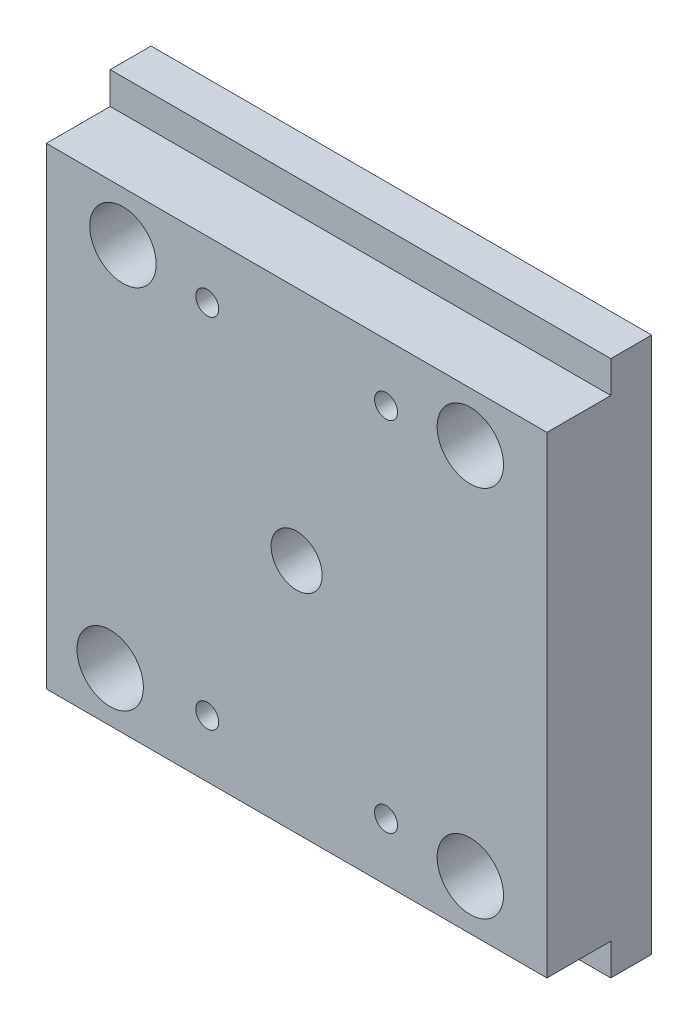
ISO-10303-21;
HEADER;
FILE_DESCRIPTION(('STEP AP214'),'2;1');
FILE_NAME('part.step','',(''),(''),'','','');
FILE_SCHEMA(('AUTOMOTIVE_DESIGN { 1 0 10303 214 1 1 1 1 }'));
ENDSEC;
DATA;
#1=APPLICATION_CONTEXT('core data for automotive mechanical design processes');
#2=APPLICATION_PROTOCOL_DEFINITION('international standard','automotive_design',2000,#1);
#3=PRODUCT_CONTEXT('',#1,'mechanical');
#4=PRODUCT('Part','Part','',(#3));
#5=PRODUCT_RELATED_PRODUCT_CATEGORY('part','',(#4));
#6=PRODUCT_DEFINITION_FORMATION('','',#4);
#7=PRODUCT_DEFINITION_CONTEXT('part definition',#1,'design');
#8=PRODUCT_DEFINITION('design','',#6,#7);
#9=PRODUCT_DEFINITION_SHAPE('','',#8);
#10=(LENGTH_UNIT() NAMED_UNIT(*) SI_UNIT(.MILLI.,.METRE.));
#11=(NAMED_UNIT(*) PLANE_ANGLE_UNIT() SI_UNIT($,.RADIAN.));
#12=(NAMED_UNIT(*) SI_UNIT($,.STERADIAN.) SOLID_ANGLE_UNIT());
#13=UNCERTAINTY_MEASURE_WITH_UNIT(LENGTH_MEASURE(1.E-05),#10,'distance_accuracy_value','');
#14=(GEOMETRIC_REPRESENTATION_CONTEXT(3) GLOBAL_UNCERTAINTY_ASSIGNED_CONTEXT((#13)) GLOBAL_UNIT_ASSIGNED_CONTEXT((#10,
#11,#12)) REPRESENTATION_CONTEXT('',''));
#15=CARTESIAN_POINT('',(0.,0.,0.));
#16=DIRECTION('',(0.,0.,1.));
#17=DIRECTION('',(1.,0.,0.));
#18=AXIS2_PLACEMENT_3D('',#15,#16,#17);
#19=CARTESIAN_POINT('',(0.,0.,16.0000000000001));
#20=DIRECTION('',(0.,0.,-1.00000000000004));
#21=DIRECTION('',(-1.,0.,0.));
#22=AXIS2_PLACEMENT_3D('',#19,#20,#21);
#23=PLANE('',#22);
#24=DIRECTION('',(-1.,0.,0.));
#25=VECTOR('',#24,1.);
#26=CARTESIAN_POINT('',(3.86496390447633E-12,197.500000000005,16.));
#27=LINE('',#26,#25);
#28=CARTESIAN_POINT('',(196.,197.50000000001,16.));
#29=VERTEX_POINT('',#28);
#30=CARTESIAN_POINT('',(3.86496390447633E-12,197.500000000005,16.));
#31=VERTEX_POINT('',#30);
#32=EDGE_CURVE('E54',#29,#31,#27,.T.);
#33=ORIENTED_EDGE('',*,*,#32,.F.);
#34=DIRECTION('',(0.,1.00000000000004,0.));
#35=VECTOR('',#34,1.);
#36=CARTESIAN_POINT('',(196.,0.,16.));
#37=LINE('',#36,#35);
#38=CARTESIAN_POINT('',(196.,210.00000000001,16.0000000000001));
#39=VERTEX_POINT('',#38);
#40=EDGE_CURVE('E111',#29,#39,#37,.T.);
#41=ORIENTED_EDGE('',*,*,#40,.T.);
#42=DIRECTION('',(-1.,0.,0.));
#43=VECTOR('',#42,1.);
#44=CARTESIAN_POINT('',(3.87190279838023E-12,210.000000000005,16.));
#45=LINE('',#44,#43);
#46=CARTESIAN_POINT('',(3.87190279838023E-12,210.000000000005,16.));
#47=VERTEX_POINT('',#46);
#48=EDGE_CURVE('E110',#39,#47,#45,.T.);
#49=ORIENTED_EDGE('',*,*,#48,.T.);
#50=DIRECTION('',(0.,-1.00000000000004,0.));
#51=VECTOR('',#50,1.);
#52=CARTESIAN_POINT('',(0.,0.,16.0000000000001));
#53=LINE('',#52,#51);
#54=EDGE_CURVE('E170',#47,#31,#53,.T.);
#55=ORIENTED_EDGE('',*,*,#54,.T.);
#56=EDGE_LOOP('',(#33,#41,#49,#55));
#57=FACE_BOUND('',#56,.T.);
#58=ADVANCED_FACE('F37',(#57),#23,.F.);
#59=DIRECTION('',(1.,0.,0.));
#60=VECTOR('',#59,1.);
#61=CARTESIAN_POINT('',(6.66133814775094E-13,12.5,16.0000000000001));
#62=LINE('',#61,#60);
#63=CARTESIAN_POINT('',(6.45317133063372E-13,12.5,16.0000000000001));
#64=VERTEX_POINT('',#63);
#65=CARTESIAN_POINT('',(196.,12.5,16.));
#66=VERTEX_POINT('',#65);
#67=EDGE_CURVE('E62',#64,#66,#62,.T.);
#68=ORIENTED_EDGE('',*,*,#67,.F.);
#69=CARTESIAN_POINT('',(0.,0.,16.0000000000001));
#70=VERTEX_POINT('',#69);
#71=EDGE_CURVE('E163',#64,#70,#53,.T.);
#72=ORIENTED_EDGE('',*,*,#71,.T.);
#73=DIRECTION('',(1.,0.,0.));
#74=VECTOR('',#73,1.);
#75=CARTESIAN_POINT('',(0.,0.,16.0000000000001));
#76=LINE('',#75,#74);
#77=CARTESIAN_POINT('',(196.,0.,16.));
#78=VERTEX_POINT('',#77);
#79=EDGE_CURVE('E105',#70,#78,#76,.T.);
#80=ORIENTED_EDGE('',*,*,#79,.T.);
#81=EDGE_CURVE('E102',#78,#66,#37,.T.);
#82=ORIENTED_EDGE('',*,*,#81,.T.);
#83=EDGE_LOOP('',(#68,#72,#80,#82));
#84=FACE_BOUND('',#83,.T.);
#85=ADVANCED_FACE('F103',(#84),#23,.F.);
#86=CARTESIAN_POINT('',(0.,0.,16.0000000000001));
#87=DIRECTION('',(1.,0.,0.));
#88=DIRECTION('',(0.,0.,-1.00000000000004));
#89=AXIS2_PLACEMENT_3D('',#86,#87,#88);
#90=PLANE('',#89);
#91=DIRECTION('',(0.,-1.00000000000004,0.));
#92=VECTOR('',#91,1.);
#93=CARTESIAN_POINT('',(0.,0.,0.));
#94=LINE('',#93,#92);
#95=CARTESIAN_POINT('',(3.87190279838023E-12,210.00000000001,0.));
#96=VERTEX_POINT('',#95);
#97=CARTESIAN_POINT('',(0.,0.,0.));
#98=VERTEX_POINT('',#97);
#99=EDGE_CURVE('E128',#96,#98,#94,.T.);
#100=ORIENTED_EDGE('',*,*,#99,.T.);
#101=DIRECTION('',(0.,0.,-1.00000000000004));
#102=VECTOR('',#101,1.);
#103=CARTESIAN_POINT('',(0.,0.,16.0000000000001));
#104=LINE('',#103,#102);
#105=EDGE_CURVE('E11',#70,#98,#104,.T.);
#106=ORIENTED_EDGE('',*,*,#105,.F.);
#107=ORIENTED_EDGE('',*,*,#71,.F.);
#108=DIRECTION('',(0.,0.,-1.00000000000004));
#109=VECTOR('',#108,1.);
#110=CARTESIAN_POINT('',(0.,12.5,41.0000000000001));
#111=LINE('',#110,#109);
#112=CARTESIAN_POINT('',(0.,12.5,41.0000000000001));
#113=VERTEX_POINT('',#112);
#114=EDGE_CURVE('E120',#113,#64,#111,.T.);
#115=ORIENTED_EDGE('',*,*,#114,.F.);
#116=DIRECTION('',(0.,-1.00000000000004,0.));
#117=VECTOR('',#116,1.);
#118=CARTESIAN_POINT('',(3.87190279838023E-12,197.50000000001,41.0000000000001));
#119=LINE('',#118,#117);
#120=CARTESIAN_POINT('',(3.87190279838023E-12,197.50000000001,41.0000000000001));
#121=VERTEX_POINT('',#120);
#122=EDGE_CURVE('E142',#121,#113,#119,.T.);
#123=ORIENTED_EDGE('',*,*,#122,.F.);
#124=DIRECTION('',(0.,0.,-1.00000000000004));
#125=VECTOR('',#124,1.);
#126=CARTESIAN_POINT('',(3.87190279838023E-12,197.50000000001,41.0000000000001));
#127=LINE('',#126,#125);
#128=EDGE_CURVE('E131',#121,#31,#127,.T.);
#129=ORIENTED_EDGE('',*,*,#128,.T.);
#130=ORIENTED_EDGE('',*,*,#54,.F.);
#131=DIRECTION('',(0.,0.,-1.00000000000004));
#132=VECTOR('',#131,1.);
#133=CARTESIAN_POINT('',(3.87190279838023E-12,210.000000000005,16.));
#134=LINE('',#133,#132);
#135=EDGE_CURVE('E176',#47,#96,#134,.T.);
#136=ORIENTED_EDGE('',*,*,#135,.T.);
#137=EDGE_LOOP('',(#100,#106,#107,#115,#123,#129,#130,#136));
#138=FACE_BOUND('',#137,.T.);
#139=ADVANCED_FACE('F39',(#138),#90,.F.);
#140=CARTESIAN_POINT('',(0.,0.,16.0000000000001));
#141=DIRECTION('',(0.,1.00000000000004,0.));
#142=DIRECTION('',(0.,0.,1.00000000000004));
#143=AXIS2_PLACEMENT_3D('',#140,#141,#142);
#144=PLANE('',#143);
#145=DIRECTION('',(1.,0.,0.));
#146=VECTOR('',#145,1.);
#147=CARTESIAN_POINT('',(0.,0.,0.));
#148=LINE('',#147,#146);
#149=CARTESIAN_POINT('',(196.000000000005,0.,0.));
#150=VERTEX_POINT('',#149);
#151=EDGE_CURVE('E157',#98,#150,#148,.T.);
#152=ORIENTED_EDGE('',*,*,#151,.T.);
#153=DIRECTION('',(0.,0.,-1.00000000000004));
#154=VECTOR('',#153,1.);
#155=CARTESIAN_POINT('',(196.,0.,16.));
#156=LINE('',#155,#154);
#157=EDGE_CURVE('E46',#78,#150,#156,.T.);
#158=ORIENTED_EDGE('',*,*,#157,.F.);
#159=ORIENTED_EDGE('',*,*,#79,.F.);
#160=ORIENTED_EDGE('',*,*,#105,.T.);
#161=EDGE_LOOP('',(#152,#158,#159,#160));
#162=FACE_BOUND('',#161,.T.);
#163=ADVANCED_FACE('F201',(#162),#144,.F.);
#164=CARTESIAN_POINT('',(196.,0.,16.));
#165=DIRECTION('',(-1.,0.,0.));
#166=DIRECTION('',(0.,0.,1.00000000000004));
#167=AXIS2_PLACEMENT_3D('',#164,#165,#166);
#168=PLANE('',#167);
#169=DIRECTION('',(0.,1.00000000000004,0.));
#170=VECTOR('',#169,1.);
#171=CARTESIAN_POINT('',(196.000000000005,0.,0.));
#172=LINE('',#171,#170);
#173=CARTESIAN_POINT('',(196.000000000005,210.00000000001,0.));
#174=VERTEX_POINT('',#173);
#175=EDGE_CURVE('E159',#150,#174,#172,.T.);
#176=ORIENTED_EDGE('',*,*,#175,.T.);
#177=DIRECTION('',(0.,0.,-1.00000000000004));
#178=VECTOR('',#177,1.);
#179=CARTESIAN_POINT('',(196.,210.00000000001,16.0000000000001));
#180=LINE('',#179,#178);
#181=EDGE_CURVE('E173',#39,#174,#180,.T.);
#182=ORIENTED_EDGE('',*,*,#181,.F.);
#183=ORIENTED_EDGE('',*,*,#40,.F.);
#184=DIRECTION('',(0.,0.,-1.00000000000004));
#185=VECTOR('',#184,1.);
#186=CARTESIAN_POINT('',(196.,197.50000000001,41.0000000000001));
#187=LINE('',#186,#185);
#188=CARTESIAN_POINT('',(196.,197.50000000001,41.0000000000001));
#189=VERTEX_POINT('',#188);
#190=EDGE_CURVE('E126',#189,#29,#187,.T.);
#191=ORIENTED_EDGE('',*,*,#190,.F.);
#192=DIRECTION('',(0.,1.00000000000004,0.));
#193=VECTOR('',#192,1.);
#194=CARTESIAN_POINT('',(196.,197.50000000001,41.0000000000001));
#195=LINE('',#194,#193);
#196=CARTESIAN_POINT('',(196.,12.5,41.0000000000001));
#197=VERTEX_POINT('',#196);
#198=EDGE_CURVE('E125',#197,#189,#195,.T.);
#199=ORIENTED_EDGE('',*,*,#198,.F.);
#200=DIRECTION('',(0.,0.,-1.00000000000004));
#201=VECTOR('',#200,1.);
#202=CARTESIAN_POINT('',(196.,12.5,41.0000000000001));
#203=LINE('',#202,#201);
#204=EDGE_CURVE('E117',#197,#66,#203,.T.);
#205=ORIENTED_EDGE('',*,*,#204,.T.);
#206=ORIENTED_EDGE('',*,*,#81,.F.);
#207=ORIENTED_EDGE('',*,*,#157,.T.);
#208=EDGE_LOOP('',(#176,#182,#183,#191,#199,#205,#206,#207));
#209=FACE_BOUND('',#208,.T.);
#210=ADVANCED_FACE('F123',(#209),#168,.F.);
#211=CARTESIAN_POINT('',(3.87190279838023E-12,210.000000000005,16.));
#212=DIRECTION('',(0.,-1.00000000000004,0.));
#213=DIRECTION('',(1.,0.,0.));
#214=AXIS2_PLACEMENT_3D('',#211,#212,#213);
#215=PLANE('',#214);
#216=DIRECTION('',(-1.,0.,0.));
#217=VECTOR('',#216,1.);
#218=CARTESIAN_POINT('',(3.87190279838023E-12,210.00000000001,0.));
#219=LINE('',#218,#217);
#220=EDGE_CURVE('E161',#174,#96,#219,.T.);
#221=ORIENTED_EDGE('',*,*,#220,.T.);
#222=ORIENTED_EDGE('',*,*,#135,.F.);
#223=ORIENTED_EDGE('',*,*,#48,.F.);
#224=ORIENTED_EDGE('',*,*,#181,.T.);
#225=EDGE_LOOP('',(#221,#222,#223,#224));
#226=FACE_BOUND('',#225,.T.);
#227=ADVANCED_FACE('F187',(#226),#215,.F.);
#228=CARTESIAN_POINT('',(0.,0.,0.));
#229=DIRECTION('',(0.,0.,-1.00000000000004));
#230=DIRECTION('',(-1.,0.,0.));
#231=AXIS2_PLACEMENT_3D('',#228,#229,#230);
#232=PLANE('',#231);
#233=CARTESIAN_POINT('',(63.,35.,0.));
#234=DIRECTION('',(0.,0.,-1.00000000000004));
#235=DIRECTION('',(-1.,0.,0.));
#236=AXIS2_PLACEMENT_3D('',#233,#234,#235);
#237=CIRCLE('',#236,7.49999999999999);
#238=CARTESIAN_POINT('',(55.5,34.9999999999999,0.));
#239=VERTEX_POINT('',#238);
#240=EDGE_CURVE('E459',#239,#239,#237,.T.);
#241=ORIENTED_EDGE('',*,*,#240,.F.);
#242=EDGE_LOOP('',(#241));
#243=FACE_BOUND('',#242,.T.);
#244=CARTESIAN_POINT('',(133.000000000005,35.0000000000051,0.));
#245=DIRECTION('',(0.,0.,-1.00000000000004));
#246=DIRECTION('',(-1.,0.,0.));
#247=AXIS2_PLACEMENT_3D('',#244,#245,#246);
#248=CIRCLE('',#247,7.50000000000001);
#249=CARTESIAN_POINT('',(125.500000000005,35.000000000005,0.));
#250=VERTEX_POINT('',#249);
#251=EDGE_CURVE('E470',#250,#250,#248,.T.);
#252=ORIENTED_EDGE('',*,*,#251,.F.);
#253=EDGE_LOOP('',(#252));
#254=FACE_BOUND('',#253,.T.);
#255=CARTESIAN_POINT('',(133.000000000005,175.,0.));
#256=DIRECTION('',(0.,0.,-1.00000000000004));
#257=DIRECTION('',(-1.,0.,0.));
#258=AXIS2_PLACEMENT_3D('',#255,#256,#257);
#259=CIRCLE('',#258,7.50000000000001);
#260=CARTESIAN_POINT('',(125.500000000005,175.,0.));
#261=VERTEX_POINT('',#260);
#262=EDGE_CURVE('E480',#261,#261,#259,.T.);
#263=ORIENTED_EDGE('',*,*,#262,.F.);
#264=EDGE_LOOP('',(#263));
#265=FACE_BOUND('',#264,.T.);
#266=CARTESIAN_POINT('',(63.0000000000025,175.000000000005,0.));
#267=DIRECTION('',(0.,0.,-1.00000000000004));
#268=DIRECTION('',(-1.,0.,0.));
#269=AXIS2_PLACEMENT_3D('',#266,#267,#268);
#270=CIRCLE('',#269,7.49999999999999);
#271=CARTESIAN_POINT('',(55.5000000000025,175.000000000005,0.));
#272=VERTEX_POINT('',#271);
#273=EDGE_CURVE('E490',#272,#272,#270,.T.);
#274=ORIENTED_EDGE('',*,*,#273,.F.);
#275=EDGE_LOOP('',(#274));
#276=FACE_BOUND('',#275,.T.);
#277=CARTESIAN_POINT('',(98.,105.000000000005,0.));
#278=DIRECTION('',(0.,0.,-1.00000000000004));
#279=DIRECTION('',(-1.,0.,0.));
#280=AXIS2_PLACEMENT_3D('',#277,#278,#279);
#281=CIRCLE('',#280,9.99999999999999);
#282=CARTESIAN_POINT('',(88.,105.000000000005,0.));
#283=VERTEX_POINT('',#282);
#284=EDGE_CURVE('E494',#283,#283,#281,.T.);
#285=ORIENTED_EDGE('',*,*,#284,.F.);
#286=EDGE_LOOP('',(#285));
#287=FACE_BOUND('',#286,.T.);
#288=CARTESIAN_POINT('',(25.0000000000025,32.,0.));
#289=DIRECTION('',(0.,0.,-1.00000000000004));
#290=DIRECTION('',(-1.,0.,0.));
#291=AXIS2_PLACEMENT_3D('',#288,#289,#290);
#292=CIRCLE('',#291,13.);
#293=CARTESIAN_POINT('',(12.0000000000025,31.9999999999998,0.));
#294=VERTEX_POINT('',#293);
#295=EDGE_CURVE('E498',#294,#294,#292,.T.);
#296=ORIENTED_EDGE('',*,*,#295,.F.);
#297=EDGE_LOOP('',(#296));
#298=FACE_BOUND('',#297,.T.);
#299=CARTESIAN_POINT('',(166.000000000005,32.0000000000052,0.));
#300=DIRECTION('',(0.,0.,-1.00000000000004));
#301=DIRECTION('',(-1.,0.,0.));
#302=AXIS2_PLACEMENT_3D('',#299,#300,#301);
#303=CIRCLE('',#302,13.);
#304=CARTESIAN_POINT('',(153.000000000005,32.000000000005,0.));
#305=VERTEX_POINT('',#304);
#306=EDGE_CURVE('E502',#305,#305,#303,.T.);
#307=ORIENTED_EDGE('',*,*,#306,.F.);
#308=EDGE_LOOP('',(#307));
#309=FACE_BOUND('',#308,.T.);
#310=CARTESIAN_POINT('',(166.00000000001,178.000000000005,0.));
#311=DIRECTION('',(0.,0.,-1.00000000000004));
#312=DIRECTION('',(-1.,0.,0.));
#313=AXIS2_PLACEMENT_3D('',#310,#311,#312);
#314=CIRCLE('',#313,13.);
#315=CARTESIAN_POINT('',(153.00000000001,178.000000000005,0.));
#316=VERTEX_POINT('',#315);
#317=EDGE_CURVE('E506',#316,#316,#314,.T.);
#318=ORIENTED_EDGE('',*,*,#317,.F.);
#319=EDGE_LOOP('',(#318));
#320=FACE_BOUND('',#319,.T.);
#321=CARTESIAN_POINT('',(30.0000000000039,178.,0.));
#322=DIRECTION('',(0.,0.,-1.00000000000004));
#323=DIRECTION('',(-1.,0.,0.));
#324=AXIS2_PLACEMENT_3D('',#321,#322,#323);
#325=CIRCLE('',#324,13.);
#326=CARTESIAN_POINT('',(17.0000000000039,178.,0.));
#327=VERTEX_POINT('',#326);
#328=EDGE_CURVE('E509',#327,#327,#325,.T.);
#329=ORIENTED_EDGE('',*,*,#328,.F.);
#330=EDGE_LOOP('',(#329));
#331=FACE_BOUND('',#330,.T.);
#332=ORIENTED_EDGE('',*,*,#99,.F.);
#333=ORIENTED_EDGE('',*,*,#220,.F.);
#334=ORIENTED_EDGE('',*,*,#175,.F.);
#335=ORIENTED_EDGE('',*,*,#151,.F.);
#336=EDGE_LOOP('',(#332,#333,#334,#335));
#337=FACE_BOUND('',#336,.T.);
#338=ADVANCED_FACE('F203',(#243,#254,#265,#276,#287,#298,#309,#320,#331,#337),#232,.T.);
#339=CARTESIAN_POINT('',(0.,12.5,41.0000000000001));
#340=DIRECTION('',(0.,1.00000000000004,0.));
#341=DIRECTION('',(0.,0.,1.00000000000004));
#342=AXIS2_PLACEMENT_3D('',#339,#340,#341);
#343=PLANE('',#342);
#344=ORIENTED_EDGE('',*,*,#67,.T.);
#345=ORIENTED_EDGE('',*,*,#204,.F.);
#346=DIRECTION('',(1.,0.,0.));
#347=VECTOR('',#346,1.);
#348=CARTESIAN_POINT('',(0.,12.5,41.0000000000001));
#349=LINE('',#348,#347);
#350=EDGE_CURVE('E150',#113,#197,#349,.T.);
#351=ORIENTED_EDGE('',*,*,#350,.F.);
#352=ORIENTED_EDGE('',*,*,#114,.T.);
#353=EDGE_LOOP('',(#344,#345,#351,#352));
#354=FACE_BOUND('',#353,.T.);
#355=ADVANCED_FACE('F116',(#354),#343,.F.);
#356=CARTESIAN_POINT('',(3.87190279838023E-12,197.50000000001,41.0000000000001));
#357=DIRECTION('',(0.,-1.00000000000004,0.));
#358=DIRECTION('',(0.,0.,-1.00000000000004));
#359=AXIS2_PLACEMENT_3D('',#356,#357,#358);
#360=PLANE('',#359);
#361=ORIENTED_EDGE('',*,*,#32,.T.);
#362=ORIENTED_EDGE('',*,*,#128,.F.);
#363=DIRECTION('',(-1.,0.,0.));
#364=VECTOR('',#363,1.);
#365=CARTESIAN_POINT('',(3.87190279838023E-12,197.50000000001,41.0000000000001));
#366=LINE('',#365,#364);
#367=EDGE_CURVE('E153',#189,#121,#366,.T.);
#368=ORIENTED_EDGE('',*,*,#367,.F.);
#369=ORIENTED_EDGE('',*,*,#190,.T.);
#370=EDGE_LOOP('',(#361,#362,#368,#369));
#371=FACE_BOUND('',#370,.T.);
#372=ADVANCED_FACE('F195',(#371),#360,.F.);
#373=CARTESIAN_POINT('',(0.,12.5,41.0000000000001));
#374=DIRECTION('',(0.,0.,1.00000000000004));
#375=DIRECTION('',(1.,0.,0.));
#376=AXIS2_PLACEMENT_3D('',#373,#374,#375);
#377=PLANE('',#376);
#378=CARTESIAN_POINT('',(63.,35.,41.0000000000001));
#379=DIRECTION('',(0.,0.,1.00000000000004));
#380=DIRECTION('',(1.,0.,0.));
#381=AXIS2_PLACEMENT_3D('',#378,#379,#380);
#382=CIRCLE('',#381,4.5);
#383=CARTESIAN_POINT('',(67.4999999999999,35.0000000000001,41.0000000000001));
#384=VERTEX_POINT('',#383);
#385=EDGE_CURVE('E41',#384,#384,#382,.T.);
#386=ORIENTED_EDGE('',*,*,#385,.F.);
#387=EDGE_LOOP('',(#386));
#388=FACE_BOUND('',#387,.T.);
#389=CARTESIAN_POINT('',(133.,35.0000000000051,41.0000000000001));
#390=DIRECTION('',(0.,0.,1.00000000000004));
#391=DIRECTION('',(1.,0.,0.));
#392=AXIS2_PLACEMENT_3D('',#389,#390,#391);
#393=CIRCLE('',#392,4.5);
#394=CARTESIAN_POINT('',(137.5,35.0000000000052,41.0000000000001));
#395=VERTEX_POINT('',#394);
#396=EDGE_CURVE('E473',#395,#395,#393,.T.);
#397=ORIENTED_EDGE('',*,*,#396,.F.);
#398=EDGE_LOOP('',(#397));
#399=FACE_BOUND('',#398,.T.);
#400=CARTESIAN_POINT('',(133.,175.,41.0000000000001));
#401=DIRECTION('',(0.,0.,1.00000000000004));
#402=DIRECTION('',(1.,0.,0.));
#403=AXIS2_PLACEMENT_3D('',#400,#401,#402);
#404=CIRCLE('',#403,4.5);
#405=CARTESIAN_POINT('',(137.5,175.,41.0000000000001));
#406=VERTEX_POINT('',#405);
#407=EDGE_CURVE('E483',#406,#406,#404,.T.);
#408=ORIENTED_EDGE('',*,*,#407,.F.);
#409=EDGE_LOOP('',(#408));
#410=FACE_BOUND('',#409,.T.);
#411=CARTESIAN_POINT('',(63.0000000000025,175.000000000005,41.0000000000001));
#412=DIRECTION('',(0.,0.,1.00000000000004));
#413=DIRECTION('',(1.,0.,0.));
#414=AXIS2_PLACEMENT_3D('',#411,#412,#413);
#415=CIRCLE('',#414,4.5);
#416=CARTESIAN_POINT('',(67.5000000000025,175.000000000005,41.0000000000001));
#417=VERTEX_POINT('',#416);
#418=EDGE_CURVE('E493',#417,#417,#415,.T.);
#419=ORIENTED_EDGE('',*,*,#418,.F.);
#420=EDGE_LOOP('',(#419));
#421=FACE_BOUND('',#420,.T.);
#422=CARTESIAN_POINT('',(98.,105.000000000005,41.0000000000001));
#423=DIRECTION('',(0.,0.,1.00000000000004));
#424=DIRECTION('',(1.,0.,0.));
#425=AXIS2_PLACEMENT_3D('',#422,#423,#424);
#426=CIRCLE('',#425,9.99999999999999);
#427=CARTESIAN_POINT('',(108.,105.000000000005,41.0000000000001));
#428=VERTEX_POINT('',#427);
#429=EDGE_CURVE('E497',#428,#428,#426,.T.);
#430=ORIENTED_EDGE('',*,*,#429,.F.);
#431=EDGE_LOOP('',(#430));
#432=FACE_BOUND('',#431,.T.);
#433=CARTESIAN_POINT('',(25.0000000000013,32.,41.));
#434=DIRECTION('',(0.,0.,1.00000000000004));
#435=DIRECTION('',(1.,0.,0.));
#436=AXIS2_PLACEMENT_3D('',#433,#434,#435);
#437=CIRCLE('',#436,13.);
#438=CARTESIAN_POINT('',(38.0000000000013,32.0000000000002,41.));
#439=VERTEX_POINT('',#438);
#440=EDGE_CURVE('E501',#439,#439,#437,.T.);
#441=ORIENTED_EDGE('',*,*,#440,.F.);
#442=EDGE_LOOP('',(#441));
#443=FACE_BOUND('',#442,.T.);
#444=CARTESIAN_POINT('',(166.,32.0000000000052,41.0000000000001));
#445=DIRECTION('',(0.,0.,1.00000000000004));
#446=DIRECTION('',(1.,0.,0.));
#447=AXIS2_PLACEMENT_3D('',#444,#445,#446);
#448=CIRCLE('',#447,13.);
#449=CARTESIAN_POINT('',(179.,32.0000000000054,41.0000000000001));
#450=VERTEX_POINT('',#449);
#451=EDGE_CURVE('E505',#450,#450,#448,.T.);
#452=ORIENTED_EDGE('',*,*,#451,.F.);
#453=EDGE_LOOP('',(#452));
#454=FACE_BOUND('',#453,.T.);
#455=CARTESIAN_POINT('',(166.000000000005,178.000000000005,41.));
#456=DIRECTION('',(0.,0.,1.00000000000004));
#457=DIRECTION('',(1.,0.,0.));
#458=AXIS2_PLACEMENT_3D('',#455,#456,#457);
#459=CIRCLE('',#458,13.);
#460=CARTESIAN_POINT('',(179.000000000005,178.000000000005,41.));
#461=VERTEX_POINT('',#460);
#462=EDGE_CURVE('E508',#461,#461,#459,.T.);
#463=ORIENTED_EDGE('',*,*,#462,.F.);
#464=EDGE_LOOP('',(#463));
#465=FACE_BOUND('',#464,.T.);
#466=CARTESIAN_POINT('',(30.0000000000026,178.,41.0000000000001));
#467=DIRECTION('',(0.,0.,1.00000000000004));
#468=DIRECTION('',(1.,0.,0.));
#469=AXIS2_PLACEMENT_3D('',#466,#467,#468);
#470=CIRCLE('',#469,13.);
#471=CARTESIAN_POINT('',(43.0000000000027,178.,41.0000000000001));
#472=VERTEX_POINT('',#471);
#473=EDGE_CURVE('E121',#472,#472,#470,.T.);
#474=ORIENTED_EDGE('',*,*,#473,.F.);
#475=EDGE_LOOP('',(#474));
#476=FACE_BOUND('',#475,.T.);
#477=ORIENTED_EDGE('',*,*,#122,.T.);
#478=ORIENTED_EDGE('',*,*,#350,.T.);
#479=ORIENTED_EDGE('',*,*,#198,.T.);
#480=ORIENTED_EDGE('',*,*,#367,.T.);
#481=EDGE_LOOP('',(#477,#478,#479,#480));
#482=FACE_BOUND('',#481,.T.);
#483=ADVANCED_FACE('F198',(#388,#399,#410,#421,#432,#443,#454,#465,#476,#482),#377,.T.);
#484=CARTESIAN_POINT('',(30.0000000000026,178.,41.0000250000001));
#485=DIRECTION('',(0.,0.,-1.00000000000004));
#486=DIRECTION('',(-1.,0.,0.));
#487=AXIS2_PLACEMENT_3D('',#484,#485,#486);
#488=CYLINDRICAL_SURFACE('',#487,13.);
#489=ORIENTED_EDGE('',*,*,#473,.T.);
#490=EDGE_LOOP('',(#489));
#491=FACE_BOUND('',#490,.T.);
#492=ORIENTED_EDGE('',*,*,#328,.T.);
#493=EDGE_LOOP('',(#492));
#494=FACE_BOUND('',#493,.T.);
#495=ADVANCED_FACE('F275',(#491,#494),#488,.F.);
#496=CARTESIAN_POINT('',(166.000000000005,178.000000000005,41.0000250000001));
#497=DIRECTION('',(0.,0.,-1.00000000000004));
#498=DIRECTION('',(-1.,0.,0.));
#499=AXIS2_PLACEMENT_3D('',#496,#497,#498);
#500=CYLINDRICAL_SURFACE('',#499,13.);
#501=ORIENTED_EDGE('',*,*,#462,.T.);
#502=EDGE_LOOP('',(#501));
#503=FACE_BOUND('',#502,.T.);
#504=ORIENTED_EDGE('',*,*,#317,.T.);
#505=EDGE_LOOP('',(#504));
#506=FACE_BOUND('',#505,.T.);
#507=ADVANCED_FACE('F284',(#503,#506),#500,.F.);
#508=CARTESIAN_POINT('',(166.,32.0000000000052,41.0000250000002));
#509=DIRECTION('',(0.,0.,-1.00000000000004));
#510=DIRECTION('',(-1.,0.,0.));
#511=AXIS2_PLACEMENT_3D('',#508,#509,#510);
#512=CYLINDRICAL_SURFACE('',#511,13.);
#513=ORIENTED_EDGE('',*,*,#451,.T.);
#514=EDGE_LOOP('',(#513));
#515=FACE_BOUND('',#514,.T.);
#516=ORIENTED_EDGE('',*,*,#306,.T.);
#517=EDGE_LOOP('',(#516));
#518=FACE_BOUND('',#517,.T.);
#519=ADVANCED_FACE('F293',(#515,#518),#512,.F.);
#520=CARTESIAN_POINT('',(25.0000000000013,32.,41.0000250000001));
#521=DIRECTION('',(0.,0.,-1.00000000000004));
#522=DIRECTION('',(-1.,0.,0.));
#523=AXIS2_PLACEMENT_3D('',#520,#521,#522);
#524=CYLINDRICAL_SURFACE('',#523,13.);
#525=ORIENTED_EDGE('',*,*,#440,.T.);
#526=EDGE_LOOP('',(#525));
#527=FACE_BOUND('',#526,.T.);
#528=ORIENTED_EDGE('',*,*,#295,.T.);
#529=EDGE_LOOP('',(#528));
#530=FACE_BOUND('',#529,.T.);
#531=ADVANCED_FACE('F302',(#527,#530),#524,.F.);
#532=CARTESIAN_POINT('',(98.,105.000000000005,41.0000250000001));
#533=DIRECTION('',(0.,0.,-1.00000000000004));
#534=DIRECTION('',(-1.,0.,0.));
#535=AXIS2_PLACEMENT_3D('',#532,#533,#534);
#536=CYLINDRICAL_SURFACE('',#535,9.99999999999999);
#537=ORIENTED_EDGE('',*,*,#429,.T.);
#538=EDGE_LOOP('',(#537));
#539=FACE_BOUND('',#538,.T.);
#540=ORIENTED_EDGE('',*,*,#284,.T.);
#541=EDGE_LOOP('',(#540));
#542=FACE_BOUND('',#541,.T.);
#543=ADVANCED_FACE('F311',(#539,#542),#536,.F.);
#544=CARTESIAN_POINT('',(63.0000000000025,175.000000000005,0.));
#545=DIRECTION('',(0.,0.,-1.00000000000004));
#546=DIRECTION('',(-1.,0.,0.));
#547=AXIS2_PLACEMENT_3D('',#544,#545,#546);
#548=CYLINDRICAL_SURFACE('',#547,7.49999999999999);
#549=CARTESIAN_POINT('',(63.,175.00000000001,8.00000000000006));
#550=DIRECTION('',(0.,0.,-1.00000000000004));
#551=DIRECTION('',(-1.,0.,0.));
#552=AXIS2_PLACEMENT_3D('',#549,#550,#551);
#553=CIRCLE('',#552,7.49999999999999);
#554=CARTESIAN_POINT('',(55.5,175.00000000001,8.00000000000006));
#555=VERTEX_POINT('',#554);
#556=EDGE_CURVE('E487',#555,#555,#553,.T.);
#557=ORIENTED_EDGE('',*,*,#556,.F.);
#558=EDGE_LOOP('',(#557));
#559=FACE_BOUND('',#558,.T.);
#560=ORIENTED_EDGE('',*,*,#273,.T.);
#561=EDGE_LOOP('',(#560));
#562=FACE_BOUND('',#561,.T.);
#563=ADVANCED_FACE('F320',(#559,#562),#548,.F.);
#564=CARTESIAN_POINT('',(67.5,175.00000000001,8.00000000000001));
#565=DIRECTION('',(0.,0.,1.00000000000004));
#566=DIRECTION('',(1.,0.,0.));
#567=AXIS2_PLACEMENT_3D('',#564,#565,#566);
#568=PLANE('',#567);
#569=CARTESIAN_POINT('',(63.,175.00000000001,8.00000000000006));
#570=DIRECTION('',(0.,0.,-1.00000000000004));
#571=DIRECTION('',(-1.,0.,0.));
#572=AXIS2_PLACEMENT_3D('',#569,#570,#571);
#573=CIRCLE('',#572,4.5);
#574=CARTESIAN_POINT('',(58.5,175.00000000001,8.00000000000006));
#575=VERTEX_POINT('',#574);
#576=EDGE_CURVE('E484',#575,#575,#573,.T.);
#577=ORIENTED_EDGE('',*,*,#576,.F.);
#578=EDGE_LOOP('',(#577));
#579=FACE_BOUND('',#578,.T.);
#580=ORIENTED_EDGE('',*,*,#556,.T.);
#581=EDGE_LOOP('',(#580));
#582=FACE_BOUND('',#581,.T.);
#583=ADVANCED_FACE('F329',(#579,#582),#568,.F.);
#584=CARTESIAN_POINT('',(63.0000000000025,175.000000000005,0.));
#585=DIRECTION('',(0.,0.,-1.00000000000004));
#586=DIRECTION('',(-1.,0.,0.));
#587=AXIS2_PLACEMENT_3D('',#584,#585,#586);
#588=CYLINDRICAL_SURFACE('',#587,4.5);
#589=ORIENTED_EDGE('',*,*,#418,.T.);
#590=EDGE_LOOP('',(#589));
#591=FACE_BOUND('',#590,.T.);
#592=ORIENTED_EDGE('',*,*,#576,.T.);
#593=EDGE_LOOP('',(#592));
#594=FACE_BOUND('',#593,.T.);
#595=ADVANCED_FACE('F338',(#591,#594),#588,.F.);
#596=CARTESIAN_POINT('',(133.000000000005,175.,0.));
#597=DIRECTION('',(0.,0.,-1.00000000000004));
#598=DIRECTION('',(-1.,0.,0.));
#599=AXIS2_PLACEMENT_3D('',#596,#597,#598);
#600=CYLINDRICAL_SURFACE('',#599,7.50000000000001);
#601=CARTESIAN_POINT('',(133.000000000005,175.000000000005,8.00000000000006));
#602=DIRECTION('',(0.,0.,-1.00000000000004));
#603=DIRECTION('',(-1.,0.,0.));
#604=AXIS2_PLACEMENT_3D('',#601,#602,#603);
#605=CIRCLE('',#604,7.50000000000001);
#606=CARTESIAN_POINT('',(125.500000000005,175.000000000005,8.00000000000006));
#607=VERTEX_POINT('',#606);
#608=EDGE_CURVE('E477',#607,#607,#605,.T.);
#609=ORIENTED_EDGE('',*,*,#608,.F.);
#610=EDGE_LOOP('',(#609));
#611=FACE_BOUND('',#610,.T.);
#612=ORIENTED_EDGE('',*,*,#262,.T.);
#613=EDGE_LOOP('',(#612));
#614=FACE_BOUND('',#613,.T.);
#615=ADVANCED_FACE('F347',(#611,#614),#600,.F.);
#616=CARTESIAN_POINT('',(137.500000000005,175.00000000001,8.00000000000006));
#617=DIRECTION('',(0.,0.,1.00000000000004));
#618=DIRECTION('',(1.,0.,0.));
#619=AXIS2_PLACEMENT_3D('',#616,#617,#618);
#620=PLANE('',#619);
#621=CARTESIAN_POINT('',(133.000000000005,175.000000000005,8.00000000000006));
#622=DIRECTION('',(0.,0.,-1.00000000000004));
#623=DIRECTION('',(-1.,0.,0.));
#624=AXIS2_PLACEMENT_3D('',#621,#622,#623);
#625=CIRCLE('',#624,4.5);
#626=CARTESIAN_POINT('',(128.500000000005,175.000000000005,8.00000000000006));
#627=VERTEX_POINT('',#626);
#628=EDGE_CURVE('E474',#627,#627,#625,.T.);
#629=ORIENTED_EDGE('',*,*,#628,.F.);
#630=EDGE_LOOP('',(#629));
#631=FACE_BOUND('',#630,.T.);
#632=ORIENTED_EDGE('',*,*,#608,.T.);
#633=EDGE_LOOP('',(#632));
#634=FACE_BOUND('',#633,.T.);
#635=ADVANCED_FACE('F356',(#631,#634),#620,.F.);
#636=CARTESIAN_POINT('',(133.000000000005,175.,0.));
#637=DIRECTION('',(0.,0.,-1.00000000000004));
#638=DIRECTION('',(-1.,0.,0.));
#639=AXIS2_PLACEMENT_3D('',#636,#637,#638);
#640=CYLINDRICAL_SURFACE('',#639,4.5);
#641=ORIENTED_EDGE('',*,*,#407,.T.);
#642=EDGE_LOOP('',(#641));
#643=FACE_BOUND('',#642,.T.);
#644=ORIENTED_EDGE('',*,*,#628,.T.);
#645=EDGE_LOOP('',(#644));
#646=FACE_BOUND('',#645,.T.);
#647=ADVANCED_FACE('F365',(#643,#646),#640,.F.);
#648=CARTESIAN_POINT('',(133.000000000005,35.0000000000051,0.));
#649=DIRECTION('',(0.,0.,-1.00000000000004));
#650=DIRECTION('',(-1.,0.,0.));
#651=AXIS2_PLACEMENT_3D('',#648,#649,#650);
#652=CYLINDRICAL_SURFACE('',#651,7.50000000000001);
#653=CARTESIAN_POINT('',(133.000000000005,35.,8.00000000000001));
#654=DIRECTION('',(0.,0.,-1.00000000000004));
#655=DIRECTION('',(-1.,0.,0.));
#656=AXIS2_PLACEMENT_3D('',#653,#654,#655);
#657=CIRCLE('',#656,7.50000000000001);
#658=CARTESIAN_POINT('',(125.500000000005,34.9999999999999,8.00000000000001));
#659=VERTEX_POINT('',#658);
#660=EDGE_CURVE('E467',#659,#659,#657,.T.);
#661=ORIENTED_EDGE('',*,*,#660,.F.);
#662=EDGE_LOOP('',(#661));
#663=FACE_BOUND('',#662,.T.);
#664=ORIENTED_EDGE('',*,*,#251,.T.);
#665=EDGE_LOOP('',(#664));
#666=FACE_BOUND('',#665,.T.);
#667=ADVANCED_FACE('F374',(#663,#666),#652,.F.);
#668=CARTESIAN_POINT('',(137.500000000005,35.,8.00000000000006));
#669=DIRECTION('',(0.,0.,1.00000000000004));
#670=DIRECTION('',(1.,0.,0.));
#671=AXIS2_PLACEMENT_3D('',#668,#669,#670);
#672=PLANE('',#671);
#673=CARTESIAN_POINT('',(133.000000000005,35.,8.00000000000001));
#674=DIRECTION('',(0.,0.,-1.00000000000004));
#675=DIRECTION('',(-1.,0.,0.));
#676=AXIS2_PLACEMENT_3D('',#673,#674,#675);
#677=CIRCLE('',#676,4.5);
#678=CARTESIAN_POINT('',(128.500000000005,34.9999999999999,8.00000000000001));
#679=VERTEX_POINT('',#678);
#680=EDGE_CURVE('E464',#679,#679,#677,.T.);
#681=ORIENTED_EDGE('',*,*,#680,.F.);
#682=EDGE_LOOP('',(#681));
#683=FACE_BOUND('',#682,.T.);
#684=ORIENTED_EDGE('',*,*,#660,.T.);
#685=EDGE_LOOP('',(#684));
#686=FACE_BOUND('',#685,.T.);
#687=ADVANCED_FACE('F383',(#683,#686),#672,.F.);
#688=CARTESIAN_POINT('',(133.000000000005,35.0000000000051,0.));
#689=DIRECTION('',(0.,0.,-1.00000000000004));
#690=DIRECTION('',(-1.,0.,0.));
#691=AXIS2_PLACEMENT_3D('',#688,#689,#690);
#692=CYLINDRICAL_SURFACE('',#691,4.5);
#693=ORIENTED_EDGE('',*,*,#396,.T.);
#694=EDGE_LOOP('',(#693));
#695=FACE_BOUND('',#694,.T.);
#696=ORIENTED_EDGE('',*,*,#680,.T.);
#697=EDGE_LOOP('',(#696));
#698=FACE_BOUND('',#697,.T.);
#699=ADVANCED_FACE('F392',(#695,#698),#692,.F.);
#700=CARTESIAN_POINT('',(63.,35.,0.));
#701=DIRECTION('',(0.,0.,-1.00000000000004));
#702=DIRECTION('',(-1.,0.,0.));
#703=AXIS2_PLACEMENT_3D('',#700,#701,#702);
#704=CYLINDRICAL_SURFACE('',#703,7.49999999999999);
#705=CARTESIAN_POINT('',(62.9999999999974,35.,8.00000000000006));
#706=DIRECTION('',(0.,0.,-1.00000000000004));
#707=DIRECTION('',(-1.,0.,0.));
#708=AXIS2_PLACEMENT_3D('',#705,#706,#707);
#709=CIRCLE('',#708,7.49999999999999);
#710=CARTESIAN_POINT('',(55.4999999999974,34.9999999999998,8.00000000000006));
#711=VERTEX_POINT('',#710);
#712=EDGE_CURVE('E456',#711,#711,#709,.T.);
#713=ORIENTED_EDGE('',*,*,#712,.F.);
#714=EDGE_LOOP('',(#713));
#715=FACE_BOUND('',#714,.T.);
#716=ORIENTED_EDGE('',*,*,#240,.T.);
#717=EDGE_LOOP('',(#716));
#718=FACE_BOUND('',#717,.T.);
#719=ADVANCED_FACE('F401',(#715,#718),#704,.F.);
#720=CARTESIAN_POINT('',(67.4999999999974,35.,8.00000000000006));
#721=DIRECTION('',(0.,0.,1.00000000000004));
#722=DIRECTION('',(1.,0.,0.));
#723=AXIS2_PLACEMENT_3D('',#720,#721,#722);
#724=PLANE('',#723);
#725=CARTESIAN_POINT('',(62.9999999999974,35.,8.00000000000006));
#726=DIRECTION('',(0.,0.,-1.00000000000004));
#727=DIRECTION('',(-1.,0.,0.));
#728=AXIS2_PLACEMENT_3D('',#725,#726,#727);
#729=CIRCLE('',#728,4.5);
#730=CARTESIAN_POINT('',(58.4999999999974,34.9999999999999,8.00000000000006));
#731=VERTEX_POINT('',#730);
#732=EDGE_CURVE('E455',#731,#731,#729,.T.);
#733=ORIENTED_EDGE('',*,*,#732,.F.);
#734=EDGE_LOOP('',(#733));
#735=FACE_BOUND('',#734,.T.);
#736=ORIENTED_EDGE('',*,*,#712,.T.);
#737=EDGE_LOOP('',(#736));
#738=FACE_BOUND('',#737,.T.);
#739=ADVANCED_FACE('F410',(#735,#738),#724,.F.);
#740=CARTESIAN_POINT('',(63.,35.,0.));
#741=DIRECTION('',(0.,0.,-1.00000000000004));
#742=DIRECTION('',(-1.,0.,0.));
#743=AXIS2_PLACEMENT_3D('',#740,#741,#742);
#744=CYLINDRICAL_SURFACE('',#743,4.5);
#745=ORIENTED_EDGE('',*,*,#385,.T.);
#746=EDGE_LOOP('',(#745));
#747=FACE_BOUND('',#746,.T.);
#748=ORIENTED_EDGE('',*,*,#732,.T.);
#749=EDGE_LOOP('',(#748));
#750=FACE_BOUND('',#749,.T.);
#751=ADVANCED_FACE('F419',(#747,#750),#744,.F.);
#752=CLOSED_SHELL('',(#58,#85,#139,#163,#210,#227,#338,#355,#372,#483,#495,#507,#519,#531,#543,
#563,#583,#595,#615,#635,#647,#667,#687,#699,#719,#739,#751));
#753=MANIFOLD_SOLID_BREP('B2',#752);
#754=ADVANCED_BREP_SHAPE_REPRESENTATION('',(#18,#753),#14);
#755=SHAPE_DEFINITION_REPRESENTATION(#9,#754);
ENDSEC;
END-ISO-10303-21;
